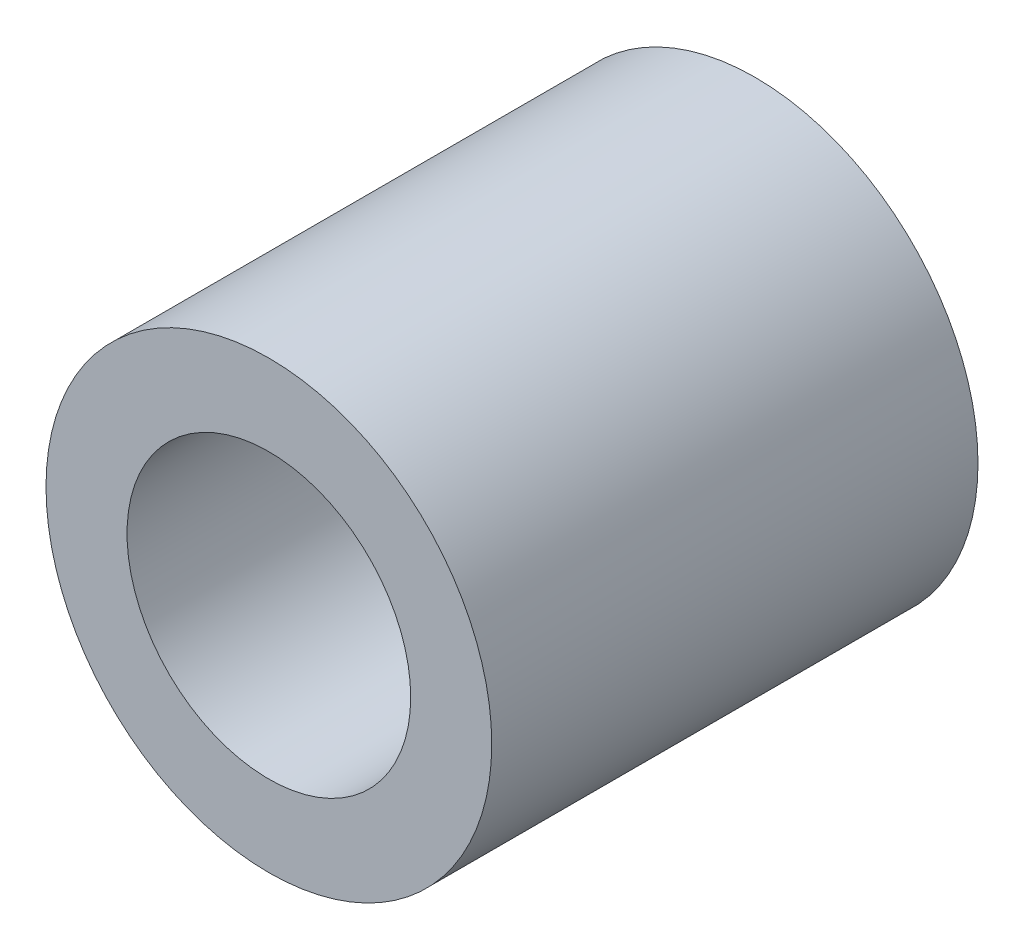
from build123d import *

# Parameters (mm, degrees)
SKETCH_3_R      = 11
SKETCH_3_R_2    = 7
EXTRUDE_2_DEPTH = 24


with BuildPart() as part:
    # Sketch 3 → Extrude 2 (new body)
    with BuildSketch(Plane.XY.offset(-6)):
        with Locations((0, 32)):
            Circle(SKETCH_3_R)
        with Locations((0, 32)):
            Circle(SKETCH_3_R_2, mode=Mode.SUBTRACT)
    extrude(amount=EXTRUDE_2_DEPTH)


solid = part.part
